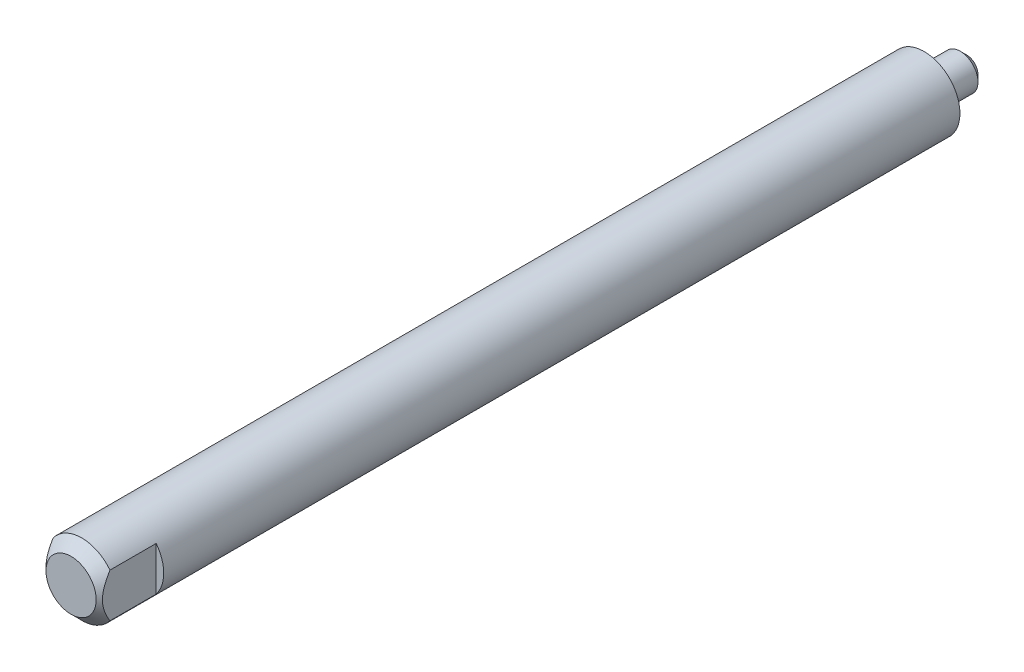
ISO-10303-21;
HEADER;
FILE_DESCRIPTION(('STEP AP214'),'2;1');
FILE_NAME('part.step','',(''),(''),'','','');
FILE_SCHEMA(('AUTOMOTIVE_DESIGN { 1 0 10303 214 1 1 1 1 }'));
ENDSEC;
DATA;
#1=APPLICATION_CONTEXT('core data for automotive mechanical design processes');
#2=APPLICATION_PROTOCOL_DEFINITION('international standard','automotive_design',2000,#1);
#3=PRODUCT_CONTEXT('',#1,'mechanical');
#4=PRODUCT('Part','Part','',(#3));
#5=PRODUCT_RELATED_PRODUCT_CATEGORY('part','',(#4));
#6=PRODUCT_DEFINITION_FORMATION('','',#4);
#7=PRODUCT_DEFINITION_CONTEXT('part definition',#1,'design');
#8=PRODUCT_DEFINITION('design','',#6,#7);
#9=PRODUCT_DEFINITION_SHAPE('','',#8);
#10=(LENGTH_UNIT() NAMED_UNIT(*) SI_UNIT(.MILLI.,.METRE.));
#11=(NAMED_UNIT(*) PLANE_ANGLE_UNIT() SI_UNIT($,.RADIAN.));
#12=(NAMED_UNIT(*) SI_UNIT($,.STERADIAN.) SOLID_ANGLE_UNIT());
#13=UNCERTAINTY_MEASURE_WITH_UNIT(LENGTH_MEASURE(1.E-05),#10,'distance_accuracy_value','');
#14=(GEOMETRIC_REPRESENTATION_CONTEXT(3) GLOBAL_UNCERTAINTY_ASSIGNED_CONTEXT((#13)) GLOBAL_UNIT_ASSIGNED_CONTEXT((#10,
#11,#12)) REPRESENTATION_CONTEXT('',''));
#15=CARTESIAN_POINT('',(0.,0.,0.));
#16=DIRECTION('',(0.,0.,1.));
#17=DIRECTION('',(1.,0.,0.));
#18=AXIS2_PLACEMENT_3D('',#15,#16,#17);
#19=CARTESIAN_POINT('',(5.1211434,-5.090754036,0.));
#20=DIRECTION('',(0.,0.,1.));
#21=DIRECTION('',(0.,1.,0.));
#22=AXIS2_PLACEMENT_3D('',#19,#20,#21);
#23=PLANE('',#22);
#24=CARTESIAN_POINT('',(0.,0.,0.));
#25=DIRECTION('',(0.,0.,1.));
#26=DIRECTION('',(1.,0.,0.));
#27=AXIS2_PLACEMENT_3D('',#24,#25,#26);
#28=CIRCLE('',#27,2.8);
#29=CARTESIAN_POINT('',(2.8,0.,0.));
#30=VERTEX_POINT('',#29);
#31=EDGE_CURVE('E129',#30,#30,#28,.T.);
#32=ORIENTED_EDGE('',*,*,#31,.T.);
#33=EDGE_LOOP('',(#32));
#34=FACE_BOUND('',#33,.T.);
#35=CARTESIAN_POINT('',(0.0303893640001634,0.,0.));
#36=DIRECTION('',(0.,0.,-1.));
#37=DIRECTION('',(1.,0.,0.));
#38=AXIS2_PLACEMENT_3D('',#35,#36,#37);
#39=CIRCLE('',#38,5.030389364);
#40=CARTESIAN_POINT('',(5.06077872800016,0.,0.));
#41=VERTEX_POINT('',#40);
#42=EDGE_CURVE('E81',#41,#41,#39,.F.);
#43=ORIENTED_EDGE('',*,*,#42,.F.);
#44=EDGE_LOOP('',(#43));
#45=FACE_BOUND('',#44,.T.);
#46=ADVANCED_FACE('F14',(#34,#45),#23,.F.);
#47=CARTESIAN_POINT('',(3.6031434,3.572754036,120.));
#48=DIRECTION('',(0.,0.,-1.));
#49=DIRECTION('',(0.,-1.,0.));
#50=AXIS2_PLACEMENT_3D('',#47,#48,#49);
#51=PLANE('',#50);
#52=CARTESIAN_POINT('',(0.030389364,0.,120.));
#53=DIRECTION('',(0.,0.,-1.));
#54=DIRECTION('',(1.,0.,0.));
#55=AXIS2_PLACEMENT_3D('',#52,#53,#54);
#56=CIRCLE('',#55,3.53038936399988);
#57=CARTESIAN_POINT('',(3.56077872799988,0.,120.));
#58=VERTEX_POINT('',#57);
#59=EDGE_CURVE('E85',#58,#58,#56,.F.);
#60=ORIENTED_EDGE('',*,*,#59,.T.);
#61=EDGE_LOOP('',(#60));
#62=FACE_BOUND('',#61,.T.);
#63=ADVANCED_FACE('F110',(#62),#51,.F.);
#64=CARTESIAN_POINT('',(5.0671434,3.126901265,112.));
#65=DIRECTION('',(0.,0.,-1.));
#66=DIRECTION('',(0.,-1.,0.));
#67=AXIS2_PLACEMENT_3D('',#64,#65,#66);
#68=PLANE('',#67);
#69=CARTESIAN_POINT('',(0.030389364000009,0.,111.9999999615));
#70=DIRECTION('',(0.,0.,-1.));
#71=DIRECTION('',(1.,0.,0.));
#72=AXIS2_PLACEMENT_3D('',#69,#70,#71);
#73=CIRCLE('',#72,5.030389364);
#74=CARTESIAN_POINT('',(3.99999999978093,-3.08982338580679,111.99999998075));
#75=VERTEX_POINT('',#74);
#76=CARTESIAN_POINT('',(3.99999999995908,3.08982338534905,111.99999998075));
#77=VERTEX_POINT('',#76);
#78=EDGE_CURVE('E54',#75,#77,#73,.F.);
#79=ORIENTED_EDGE('',*,*,#78,.T.);
#80=DIRECTION('',(0.,1.,0.));
#81=VECTOR('',#80,1.);
#82=CARTESIAN_POINT('',(4.,0.,112.));
#83=LINE('',#82,#81);
#84=EDGE_CURVE('E56',#75,#77,#83,.T.);
#85=ORIENTED_EDGE('',*,*,#84,.F.);
#86=EDGE_LOOP('',(#79,#85));
#87=FACE_BOUND('',#86,.T.);
#88=ADVANCED_FACE('F160',(#87),#68,.F.);
#89=CARTESIAN_POINT('',(4.,3.089823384,119.633815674));
#90=DIRECTION('',(1.,0.,0.));
#91=DIRECTION('',(0.,-1.,0.));
#92=AXIS2_PLACEMENT_3D('',#89,#90,#91);
#93=PLANE('',#92);
#94=DIRECTION('',(0.,0.,-1.));
#95=VECTOR('',#94,1.);
#96=CARTESIAN_POINT('',(3.99999999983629,3.0898233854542,59.25));
#97=LINE('',#96,#95);
#98=CARTESIAN_POINT('',(3.99999999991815,3.08982338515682,118.500000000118));
#99=VERTEX_POINT('',#98);
#100=EDGE_CURVE('E72',#77,#99,#97,.F.);
#101=ORIENTED_EDGE('',*,*,#100,.T.);
#102=CARTESIAN_POINT('',(4.00000000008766,3.08982338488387,118.500000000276));
#103=CARTESIAN_POINT('',(4.00000000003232,3.01524521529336,118.545803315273));
#104=CARTESIAN_POINT('',(4.00000000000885,2.94021166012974,118.590864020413));
#105=CARTESIAN_POINT('',(3.99999999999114,2.78912389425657,118.679280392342));
#106=CARTESIAN_POINT('',(3.99999999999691,2.71306944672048,118.722635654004));
#107=CARTESIAN_POINT('',(4.00000000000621,2.48267313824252,118.850107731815));
#108=CARTESIAN_POINT('',(4.00000000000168,2.32667126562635,118.931274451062));
#109=CARTESIAN_POINT('',(3.99999999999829,2.00639059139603,119.084801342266));
#110=CARTESIAN_POINT('',(3.99999999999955,1.84200763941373,119.156946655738));
#111=CARTESIAN_POINT('',(4.00000000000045,1.50780137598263,119.286845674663));
#112=CARTESIAN_POINT('',(4.0000000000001,1.33798705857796,119.34462191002));
#113=CARTESIAN_POINT('',(3.99999999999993,1.04971888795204,119.425835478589));
#114=CARTESIAN_POINT('',(3.99999999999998,0.932689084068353,119.454320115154));
#115=CARTESIAN_POINT('',(4.00000000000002,0.696679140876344,119.501763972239));
#116=CARTESIAN_POINT('',(4.,0.577698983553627,119.520723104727));
#117=CARTESIAN_POINT('',(4.,0.339668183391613,119.54800986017));
#118=CARTESIAN_POINT('',(4.,0.220629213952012,119.556437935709));
#119=CARTESIAN_POINT('',(4.,-0.0177222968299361,119.562527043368));
#120=CARTESIAN_POINT('',(4.,-0.137034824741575,119.560188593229));
#121=CARTESIAN_POINT('',(4.,-0.374862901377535,119.544883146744));
#122=CARTESIAN_POINT('',(4.,-0.493379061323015,119.531925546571));
#123=CARTESIAN_POINT('',(4.,-0.728877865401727,119.496098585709));
#124=CARTESIAN_POINT('',(4.,-0.845860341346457,119.47322814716));
#125=CARTESIAN_POINT('',(4.,-1.1957028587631,119.390835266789));
#126=CARTESIAN_POINT('',(4.,-1.42540833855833,119.317693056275));
#127=CARTESIAN_POINT('',(4.,-1.77688352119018,119.182830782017));
#128=CARTESIAN_POINT('',(4.,-1.90227100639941,119.129907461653));
#129=CARTESIAN_POINT('',(4.,-2.15003443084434,119.01726291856));
#130=CARTESIAN_POINT('',(4.,-2.2724092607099,118.957539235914));
#131=CARTESIAN_POINT('',(4.,-2.51204634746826,118.833814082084));
#132=CARTESIAN_POINT('',(4.,-2.62936141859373,118.769913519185));
#133=CARTESIAN_POINT('',(4.,-2.86141123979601,118.637895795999));
#134=CARTESIAN_POINT('',(4.,-2.97614897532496,118.569783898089));
#135=CARTESIAN_POINT('',(4.,-3.08982338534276,118.499999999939));
#136=B_SPLINE_CURVE_WITH_KNOTS('',3,(#102,#103,#104,#105,#106,#107,#108,#109,#110,#111,#112,
#113,#114,#115,#116,#117,#118,#119,#120,#121,#122,#123,#124,#125,#126,#127,#128,#129,#130,#131,
#132,#133,#134,#135),.UNSPECIFIED.,.F.,.F.,(4,2,2,2,2,2,2,2,2,2,2,2,2,2,2,2,4),(0.,
0.262553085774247,0.525168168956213,1.05242053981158,1.59049087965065,2.12771215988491,
2.48871610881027,2.84972339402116,3.20726017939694,3.56477977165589,3.92198335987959,
4.27922579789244,4.99980825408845,5.40797393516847,5.81628773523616,6.21696425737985,
6.61714984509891),.UNSPECIFIED.);
#137=CARTESIAN_POINT('',(3.99999999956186,-3.08982338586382,118.499999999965));
#138=VERTEX_POINT('',#137);
#139=EDGE_CURVE('E68',#99,#138,#136,.T.);
#140=ORIENTED_EDGE('',*,*,#139,.T.);
#141=DIRECTION('',(0.,0.,1.));
#142=VECTOR('',#141,1.);
#143=CARTESIAN_POINT('',(3.99999999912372,-3.08982338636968,59.25));
#144=LINE('',#143,#142);
#145=EDGE_CURVE('E84',#138,#75,#144,.F.);
#146=ORIENTED_EDGE('',*,*,#145,.T.);
#147=ORIENTED_EDGE('',*,*,#84,.T.);
#148=EDGE_LOOP('',(#101,#140,#146,#147));
#149=FACE_BOUND('',#148,.T.);
#150=ADVANCED_FACE('F154',(#149),#93,.T.);
#151=CARTESIAN_POINT('',(-4.,-3.046234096,112.));
#152=DIRECTION('',(0.,0.,1.));
#153=DIRECTION('',(0.,1.,0.));
#154=AXIS2_PLACEMENT_3D('',#151,#152,#153);
#155=PLANE('',#154);
#156=DIRECTION('',(0.,-1.,0.));
#157=VECTOR('',#156,1.);
#158=CARTESIAN_POINT('',(-4.,0.,112.));
#159=LINE('',#158,#157);
#160=CARTESIAN_POINT('',(-4.00000000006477,3.01011274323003,111.99999998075));
#161=VERTEX_POINT('',#160);
#162=CARTESIAN_POINT('',(-3.99999999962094,-3.01011274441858,111.99999998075));
#163=VERTEX_POINT('',#162);
#164=EDGE_CURVE('E62',#161,#163,#159,.T.);
#165=ORIENTED_EDGE('',*,*,#164,.F.);
#166=CARTESIAN_POINT('',(0.030389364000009,0.,111.9999999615));
#167=DIRECTION('',(0.,0.,-1.));
#168=DIRECTION('',(1.,0.,0.));
#169=AXIS2_PLACEMENT_3D('',#166,#167,#168);
#170=CIRCLE('',#169,5.030389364);
#171=EDGE_CURVE('E66',#161,#163,#170,.F.);
#172=ORIENTED_EDGE('',*,*,#171,.T.);
#173=EDGE_LOOP('',(#165,#172));
#174=FACE_BOUND('',#173,.T.);
#175=ADVANCED_FACE('F64',(#174),#155,.T.);
#176=CARTESIAN_POINT('',(-4.,3.010112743,112.));
#177=DIRECTION('',(-1.,0.,0.));
#178=DIRECTION('',(0.,-1.,0.));
#179=AXIS2_PLACEMENT_3D('',#176,#177,#178);
#180=PLANE('',#179);
#181=DIRECTION('',(0.,0.,-1.));
#182=VECTOR('',#181,1.);
#183=CARTESIAN_POINT('',(-3.99999999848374,-3.01011274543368,59.25));
#184=LINE('',#183,#182);
#185=CARTESIAN_POINT('',(-3.99999999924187,-3.0101127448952,118.499999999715));
#186=VERTEX_POINT('',#185);
#187=EDGE_CURVE('E31',#163,#186,#184,.F.);
#188=ORIENTED_EDGE('',*,*,#187,.T.);
#189=CARTESIAN_POINT('',(-3.99999999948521,-3.01011274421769,118.499999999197));
#190=CARTESIAN_POINT('',(-3.99999999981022,-2.93602213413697,118.544329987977));
#191=CARTESIAN_POINT('',(-3.99999999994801,-2.86147354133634,118.587893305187));
#192=CARTESIAN_POINT('',(-4.000000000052,-2.71135486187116,118.67326450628));
#193=CARTESIAN_POINT('',(-4.00000000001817,-2.63578452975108,118.715071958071));
#194=CARTESIAN_POINT('',(-3.99999999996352,-2.40686097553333,118.837804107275));
#195=CARTESIAN_POINT('',(-3.99999999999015,-2.25185492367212,118.915699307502));
#196=CARTESIAN_POINT('',(-4.00000000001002,-1.9341136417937,119.062212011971));
#197=CARTESIAN_POINT('',(-4.00000000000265,-1.77128998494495,119.130639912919));
#198=CARTESIAN_POINT('',(-3.99999999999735,-1.44045545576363,119.253073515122));
#199=CARTESIAN_POINT('',(-3.99999999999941,-1.27245300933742,119.307101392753));
#200=CARTESIAN_POINT('',(-4.00000000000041,-0.984493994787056,119.38305208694));
#201=CARTESIAN_POINT('',(-4.00000000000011,-0.865794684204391,119.409735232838));
#202=CARTESIAN_POINT('',(-3.99999999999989,-0.626573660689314,119.453280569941));
#203=CARTESIAN_POINT('',(-3.99999999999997,-0.506051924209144,119.470142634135));
#204=CARTESIAN_POINT('',(-4.00000000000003,-0.26504479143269,119.493059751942));
#205=CARTESIAN_POINT('',(-4.00000000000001,-0.144568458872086,119.499208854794));
#206=CARTESIAN_POINT('',(-3.99999999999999,0.0964457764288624,119.500647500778));
#207=CARTESIAN_POINT('',(-4.,0.216983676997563,119.495937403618));
#208=CARTESIAN_POINT('',(-4.,0.456922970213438,119.475941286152));
#209=CARTESIAN_POINT('',(-4.,0.576326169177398,119.460676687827));
#210=CARTESIAN_POINT('',(-4.,0.81344860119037,119.4203937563));
#211=CARTESIAN_POINT('',(-4.,0.931167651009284,119.395374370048));
#212=CARTESIAN_POINT('',(-4.,1.2828698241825,119.306874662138));
#213=CARTESIAN_POINT('',(-4.,1.51356891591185,119.230133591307));
#214=CARTESIAN_POINT('',(-4.,1.8502837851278,119.096757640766));
#215=CARTESIAN_POINT('',(-4.,1.96032586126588,119.049595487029));
#216=CARTESIAN_POINT('',(-4.,2.17810726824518,118.950124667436));
#217=CARTESIAN_POINT('',(-4.,2.28584623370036,118.897815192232));
#218=CARTESIAN_POINT('',(-4.,2.4974523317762,118.789805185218));
#219=CARTESIAN_POINT('',(-4.,2.60135371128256,118.734170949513));
#220=CARTESIAN_POINT('',(-4.,2.8071592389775,118.619488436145));
#221=CARTESIAN_POINT('',(-4.,2.90906479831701,118.560442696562));
#222=CARTESIAN_POINT('',(-4.,3.01011274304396,118.500000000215));
#223=B_SPLINE_CURVE_WITH_KNOTS('',3,(#189,#190,#191,#192,#193,#194,#195,#196,#197,#198,#199,
#200,#201,#202,#203,#204,#205,#206,#207,#208,#209,#210,#211,#212,#213,#214,#215,#216,#217,#218,
#219,#220,#221,#222),.UNSPECIFIED.,.F.,.F.,(4,2,2,2,2,2,2,2,2,2,2,2,2,2,2,2,4),(0.,
0.259010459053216,0.518084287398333,1.03819340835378,1.567550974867,2.0960885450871,
2.4607187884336,2.82535374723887,3.18677112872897,3.54817653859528,3.90885056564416,
4.26956353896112,4.99644414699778,5.35554865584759,5.71470971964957,6.06822034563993,
6.4214712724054),.UNSPECIFIED.);
#224=CARTESIAN_POINT('',(-4.00000000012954,3.01011274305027,118.500000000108));
#225=VERTEX_POINT('',#224);
#226=EDGE_CURVE('E67',#186,#225,#223,.T.);
#227=ORIENTED_EDGE('',*,*,#226,.T.);
#228=DIRECTION('',(0.,0.,1.));
#229=VECTOR('',#228,1.);
#230=CARTESIAN_POINT('',(-4.00000000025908,3.01011274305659,59.25));
#231=LINE('',#230,#229);
#232=EDGE_CURVE('E70',#225,#161,#231,.F.);
#233=ORIENTED_EDGE('',*,*,#232,.T.);
#234=ORIENTED_EDGE('',*,*,#164,.T.);
#235=EDGE_LOOP('',(#188,#227,#233,#234));
#236=FACE_BOUND('',#235,.T.);
#237=ADVANCED_FACE('F71',(#236),#180,.T.);
#238=CARTESIAN_POINT('',(0.030389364,0.,120.));
#239=DIRECTION('',(0.,0.,-1.));
#240=DIRECTION('',(1.,0.,0.));
#241=AXIS2_PLACEMENT_3D('',#238,#239,#240);
#242=CONICAL_SURFACE('',#241,3.530389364,0.785398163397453);
#243=CARTESIAN_POINT('',(0.030389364,0.,118.5));
#244=DIRECTION('',(0.,0.,-1.));
#245=DIRECTION('',(0.,-1.,0.));
#246=AXIS2_PLACEMENT_3D('',#243,#244,#245);
#247=CIRCLE('',#246,5.030389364);
#248=EDGE_CURVE('E77',#186,#138,#247,.F.);
#249=ORIENTED_EDGE('',*,*,#248,.T.);
#250=ORIENTED_EDGE('',*,*,#139,.F.);
#251=CARTESIAN_POINT('',(0.030389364,0.,118.5));
#252=DIRECTION('',(0.,0.,-1.));
#253=DIRECTION('',(0.,-1.,0.));
#254=AXIS2_PLACEMENT_3D('',#251,#252,#253);
#255=CIRCLE('',#254,5.030389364);
#256=EDGE_CURVE('E47',#99,#225,#255,.F.);
#257=ORIENTED_EDGE('',*,*,#256,.T.);
#258=ORIENTED_EDGE('',*,*,#226,.F.);
#259=EDGE_LOOP('',(#249,#250,#257,#258));
#260=FACE_BOUND('',#259,.T.);
#261=ORIENTED_EDGE('',*,*,#59,.F.);
#262=EDGE_LOOP('',(#261));
#263=FACE_BOUND('',#262,.T.);
#264=ADVANCED_FACE('F101',(#260,#263),#242,.T.);
#265=CARTESIAN_POINT('',(0.030389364,0.,118.5));
#266=DIRECTION('',(0.,0.,-1.));
#267=DIRECTION('',(1.,0.,0.));
#268=AXIS2_PLACEMENT_3D('',#265,#266,#267);
#269=CYLINDRICAL_SURFACE('',#268,5.030389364);
#270=ORIENTED_EDGE('',*,*,#42,.T.);
#271=EDGE_LOOP('',(#270));
#272=FACE_BOUND('',#271,.T.);
#273=ORIENTED_EDGE('',*,*,#256,.F.);
#274=ORIENTED_EDGE('',*,*,#100,.F.);
#275=ORIENTED_EDGE('',*,*,#78,.F.);
#276=ORIENTED_EDGE('',*,*,#145,.F.);
#277=ORIENTED_EDGE('',*,*,#248,.F.);
#278=ORIENTED_EDGE('',*,*,#187,.F.);
#279=ORIENTED_EDGE('',*,*,#171,.F.);
#280=ORIENTED_EDGE('',*,*,#232,.F.);
#281=EDGE_LOOP('',(#273,#274,#275,#276,#277,#278,#279,#280));
#282=FACE_BOUND('',#281,.T.);
#283=ADVANCED_FACE('F74',(#272,#282),#269,.T.);
#284=CARTESIAN_POINT('',(0.,0.,-6.));
#285=DIRECTION('',(0.,0.,1.));
#286=DIRECTION('',(1.,0.,0.));
#287=AXIS2_PLACEMENT_3D('',#284,#285,#286);
#288=CYLINDRICAL_SURFACE('',#287,2.5);
#289=CARTESIAN_POINT('',(0.,0.,-5.1));
#290=DIRECTION('',(0.,0.,-1.));
#291=DIRECTION('',(-1.,0.,0.));
#292=AXIS2_PLACEMENT_3D('',#289,#290,#291);
#293=CIRCLE('',#292,2.5);
#294=CARTESIAN_POINT('',(-2.5,0.,-5.1));
#295=VERTEX_POINT('',#294);
#296=EDGE_CURVE('E9',#295,#295,#293,.F.);
#297=ORIENTED_EDGE('',*,*,#296,.T.);
#298=EDGE_LOOP('',(#297));
#299=FACE_BOUND('',#298,.T.);
#300=CARTESIAN_POINT('',(0.,0.,-0.3));
#301=DIRECTION('',(0.,0.,1.));
#302=DIRECTION('',(1.,0.,0.));
#303=AXIS2_PLACEMENT_3D('',#300,#301,#302);
#304=CIRCLE('',#303,2.5);
#305=CARTESIAN_POINT('',(2.5,0.,-0.3));
#306=VERTEX_POINT('',#305);
#307=EDGE_CURVE('E132',#306,#306,#304,.F.);
#308=ORIENTED_EDGE('',*,*,#307,.T.);
#309=EDGE_LOOP('',(#308));
#310=FACE_BOUND('',#309,.T.);
#311=ADVANCED_FACE('F123',(#299,#310),#288,.T.);
#312=CARTESIAN_POINT('',(0.,0.,-6.));
#313=DIRECTION('',(0.,0.,-1.));
#314=DIRECTION('',(-1.,0.,0.));
#315=AXIS2_PLACEMENT_3D('',#312,#313,#314);
#316=PLANE('',#315);
#317=CARTESIAN_POINT('',(0.,0.,-6.));
#318=DIRECTION('',(0.,0.,-1.));
#319=DIRECTION('',(-1.,0.,0.));
#320=AXIS2_PLACEMENT_3D('',#317,#318,#319);
#321=CIRCLE('',#320,1.6);
#322=CARTESIAN_POINT('',(-1.6,0.,-6.));
#323=VERTEX_POINT('',#322);
#324=EDGE_CURVE('E23',#323,#323,#321,.T.);
#325=ORIENTED_EDGE('',*,*,#324,.T.);
#326=EDGE_LOOP('',(#325));
#327=FACE_BOUND('',#326,.T.);
#328=ADVANCED_FACE('F114',(#327),#316,.T.);
#329=CARTESIAN_POINT('',(0.,0.,-0.3));
#330=DIRECTION('',(0.,0.,1.));
#331=DIRECTION('',(1.,0.,0.));
#332=AXIS2_PLACEMENT_3D('',#329,#330,#331);
#333=TOROIDAL_SURFACE('',#332,2.8,0.3);
#334=ORIENTED_EDGE('',*,*,#31,.F.);
#335=EDGE_LOOP('',(#334));
#336=FACE_BOUND('',#335,.T.);
#337=ORIENTED_EDGE('',*,*,#307,.F.);
#338=EDGE_LOOP('',(#337));
#339=FACE_BOUND('',#338,.T.);
#340=ADVANCED_FACE('F112',(#336,#339),#333,.F.);
#341=CARTESIAN_POINT('',(0.,0.,-6.));
#342=DIRECTION('',(0.,0.,1.));
#343=DIRECTION('',(1.,0.,0.));
#344=AXIS2_PLACEMENT_3D('',#341,#342,#343);
#345=CONICAL_SURFACE('',#344,1.6,0.785398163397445);
#346=ORIENTED_EDGE('',*,*,#296,.F.);
#347=EDGE_LOOP('',(#346));
#348=FACE_BOUND('',#347,.T.);
#349=ORIENTED_EDGE('',*,*,#324,.F.);
#350=EDGE_LOOP('',(#349));
#351=FACE_BOUND('',#350,.T.);
#352=ADVANCED_FACE('F16',(#348,#351),#345,.T.);
#353=CLOSED_SHELL('',(#46,#63,#88,#150,#175,#237,#264,#283,#311,#328,#340,#352));
#354=MANIFOLD_SOLID_BREP('B1',#353);
#355=ADVANCED_BREP_SHAPE_REPRESENTATION('',(#18,#354),#14);
#356=SHAPE_DEFINITION_REPRESENTATION(#9,#355);
ENDSEC;
END-ISO-10303-21;
